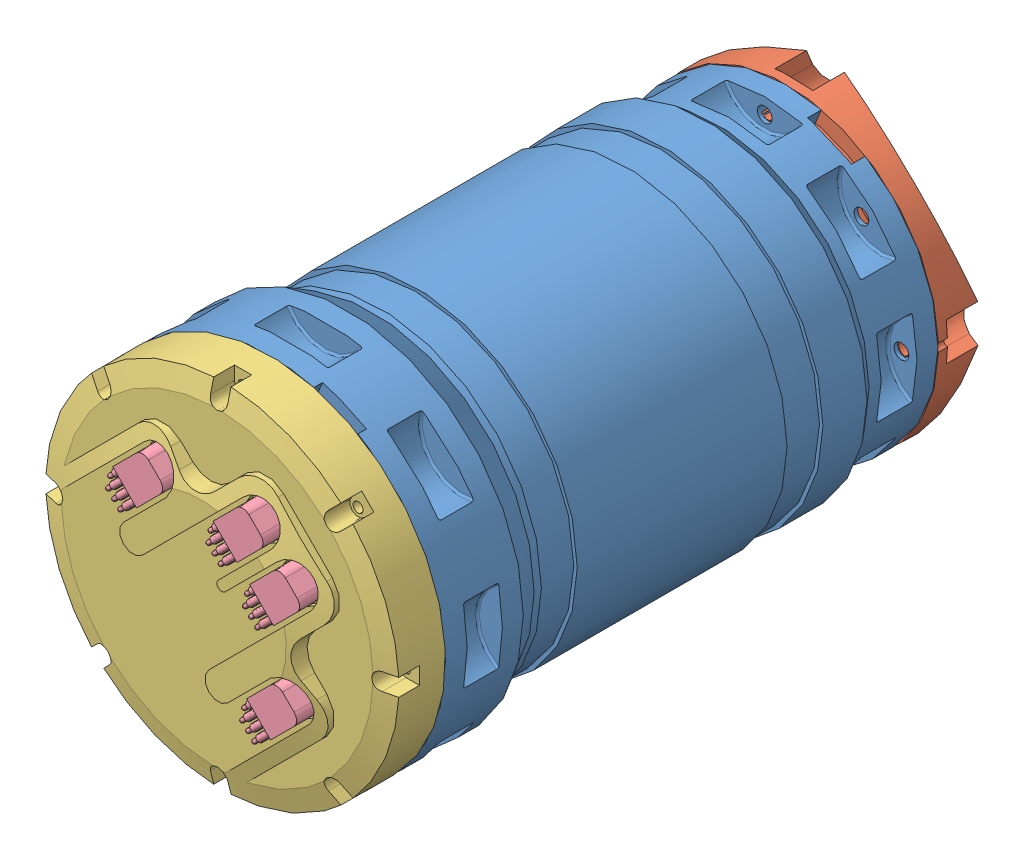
SolidWorks assembly kearfott_rev2.SLDASM, configuration Default (file format 4400). Lengths in mm.
Overall size (384.29 385.8 538.47).
7 component instances, 4 part files, 18 mates.
Components (placement in the parent):
- kearfott_case-1: kearfott_case.SLDPRT [Default] at origin size (260.35 260.35 381)
- kearfott_rev1-1: kearfott_rev1.SLDPRT [Default] at (0 0 -31.6359) x (0.703475 0.71072 0) z (0 0 -1) size (283.42 226.85 332.95)
- kearfott_endcap-1: kearfott_endcap.SLDPRT [Default] at (0 0 234.0641) x (-0.707107 0.707107 0) z (0 0 -1) size (260.35 260.35 70.79)
- ImpulseLPBH-7-MP-1: ImpulseLPBH-7-MP.sldprt [Default] at (-20.2954 60.8861 232.7941) x (-0.707107 -0.707107 0) z (-0.707107 0.707107 0) size (50.8 46.48 24.89)
- ImpulseLPBH-7-MP-2: ImpulseLPBH-7-MP.sldprt [Default] at (53.7019 63.0414 232.7941) x (-0.707107 -0.707107 0) z (-0.707107 0.707107 0) size (50.8 46.48 24.89)
- ImpulseLPBH-7-MP-3: ImpulseLPBH-7-MP.sldprt [Default] at (80.6427 36.1006 232.7941) x (-0.707107 -0.707107 0) z (-0.707107 0.707107 0) size (50.8 46.48 24.89)
- ImpulseLPBH-7-MP-4: ImpulseLPBH-7-MP.sldprt [Default] at (78.4874 -37.8967 232.7941) x (-0.707107 -0.707107 0) z (-0.707107 0.707107 0) size (50.8 46.48 24.89)
Mates (geometry in assembly coordinates):
- Coincident6: coincident anti-aligned: plane of kearfott_case-1 through (0 119.38 195.9641) normal (0 0 1); plane of kearfott_endcap-1 through (0 0 195.9641) normal (0 0 -1)
- Coincident8: coincident anti-aligned: line of kearfott_case-1 through (0 0 -74.5459) axis (0 0 1); line of kearfott_endcap-1 through (0 0 273.8965) axis (0 0 -1)
- Concentric1: concentric aligned: cylinder of kearfott_endcap-1 through (-38.0763 60.7065 176.9141) axis (0 0 1) radius 5.5499; cylinder of ImpulseLPBH-7-MP-1 through (-38.0763 60.7065 204.8541) axis (0 0 1) radius 5.5563
- Coincident9: coincident anti-aligned: plane of kearfott_endcap-1 through (-38.0763 60.7065 230.2541) normal (0 0 1); plane of ImpulseLPBH-7-MP-1 through (-38.0763 60.7065 230.2541) normal (0 0 -1)
- Parallel2: parallel aligned: plane of kearfott_endcap-1; plane of ImpulseLPBH-7-MP-1 through (-20.2954 60.8861 232.7941) normal (-0.707107 0.707107 0)
- Concentric2: concentric aligned: cylinder of kearfott_endcap-1 through (35.921 62.8618 176.9141) axis (0 0 1) radius 5.5499; cylinder of ImpulseLPBH-7-MP-2 through (35.921 62.8618 204.8541) axis (0 0 1) radius 5.5563
- Parallel3: parallel aligned: plane of ImpulseLPBH-7-MP-1; plane of ImpulseLPBH-7-MP-2
- Coincident11: coincident anti-aligned: plane of kearfott_endcap-1 through (35.921 62.8618 230.2541) normal (0 0 1); plane of ImpulseLPBH-7-MP-2 through (35.921 62.8618 230.2541) normal (0 0 -1)
- Concentric3: concentric aligned: cylinder of kearfott_endcap-1 through (62.8618 35.921 176.9141) axis (0 0 1) radius 5.5499; cylinder of ImpulseLPBH-7-MP-3 through (62.8618 35.921 204.8541) axis (0 0 1) radius 5.5563
- Parallel4: parallel aligned: plane of ImpulseLPBH-7-MP-2; plane of ImpulseLPBH-7-MP-3
- Coincident12: coincident anti-aligned: plane of kearfott_endcap-1 through (62.8618 35.921 230.2541) normal (0 0 1); plane of ImpulseLPBH-7-MP-3 through (62.8618 35.921 230.2541) normal (0 0 -1)
- Concentric4: concentric aligned: cylinder of kearfott_endcap-1 through (60.7065 -38.0763 176.9141) axis (0 0 1) radius 5.5499; cylinder of ImpulseLPBH-7-MP-4 through (60.7065 -38.0763 204.8541) axis (0 0 1) radius 5.5563
- Parallel5: parallel aligned: plane of ImpulseLPBH-7-MP-3; plane of ImpulseLPBH-7-MP-4
- Coincident13: coincident anti-aligned: plane of kearfott_endcap-1 through (60.7065 -38.0763 230.2541) normal (0 0 1); plane of ImpulseLPBH-7-MP-4 through (60.7065 -38.0763 230.2541) normal (0 0 -1)
- Concentric8: concentric anti-aligned: circle of kearfott_case-1; circle of kearfott_rev1-1
- Coincident17: coincident anti-aligned: plane of kearfott_case-1 through (0 79.375 -185.0359) normal (0 0 -1); plane of kearfott_rev1-1 through (0 0 -185.0359) normal (0 0 1)
- Concentric9: concentric aligned: cylinder of kearfott_case-1 through (-119.9261 0 -185.0369) axis (0 0 1) radius 3.7465; cylinder of kearfott_endcap-1 through (-119.9261 0 176.9141) axis (0 0 1) radius 3.7465
- PLANE1: unknown = 4101.5237 mm: line of kearfott_case-1 through (1000 -1000 0) axis (0 0 1); line of kearfott_case-1 through (0 0 -74.5459) axis (0 0 1)
